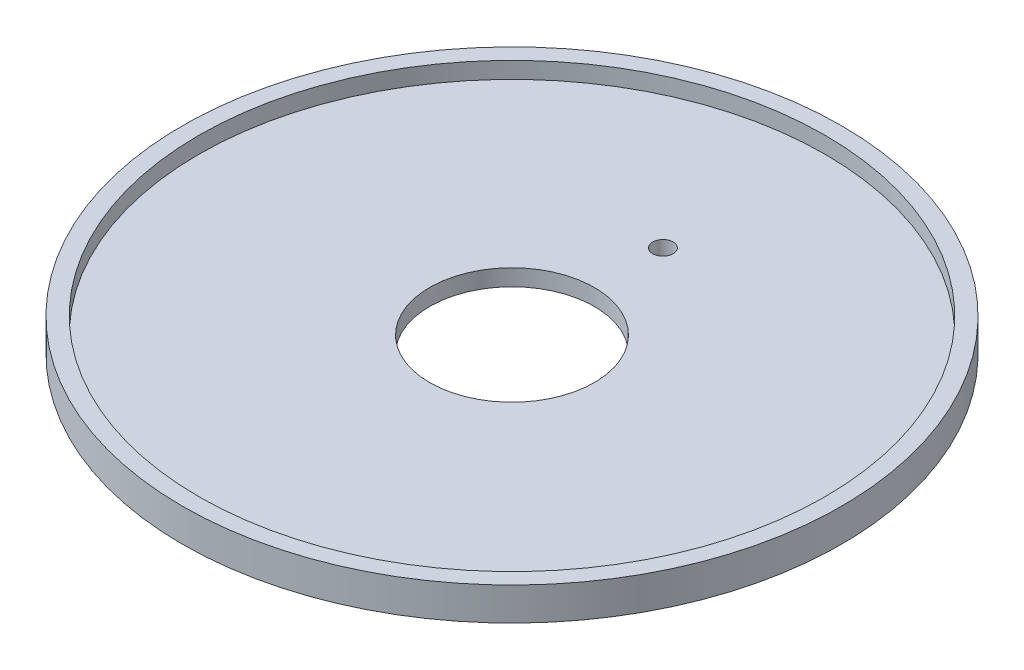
from build123d import *

# Parameters (mm, degrees)
SKETCH1_R           = 100
SKETCH1_R_2         = 25
BOSS_EXTRUDE1_DEPTH = 5
SKETCH7_R           = 100
SKETCH7_R_2         = 95
BOSS_EXTRUDE3_DEPTH = 5
SKETCH6_R           = 3.101404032
CUT_EXTRUDE1_DEPTH  = 10


with BuildPart() as part:
    # Sketch1 → Boss-Extrude1 (new body)
    with BuildSketch(Plane(origin=(0, 0, 0), x_dir=(1, 0, 0), z_dir=(0, 1, 0))):
        with Locations(Location((0, 0, 0), (0, 0, 270))):
            Circle(SKETCH1_R)
        with Locations(Location((0, 0, 0), (0, 0, 270))):
            Circle(SKETCH1_R_2, mode=Mode.SUBTRACT)
    extrude(amount=BOSS_EXTRUDE1_DEPTH)

    # Sketch7 → Boss-Extrude3 (add)
    with BuildSketch(Plane(origin=(0, 5, 0), x_dir=(1, 0, 0), z_dir=(0, 1, 0))):
        with Locations(Location((0, 0, 0), (0, 0, 270))):
            Circle(SKETCH7_R)
        with Locations(Location((0, 0, 0), (0, 0, 270))):
            Circle(SKETCH7_R_2, mode=Mode.SUBTRACT)
    extrude(amount=BOSS_EXTRUDE3_DEPTH)

    # Sketch6 → Cut-Extrude1 (cut)
    with BuildSketch(Plane(origin=(0, 5, 0), x_dir=(1, 0, 0), z_dir=(0, 1, 0))):
        with Locations(Location((0, 45.8, 0), (0, 0, 270))):
            Circle(SKETCH6_R)
    extrude(amount=-CUT_EXTRUDE1_DEPTH, mode=Mode.SUBTRACT)


solid = part.part
